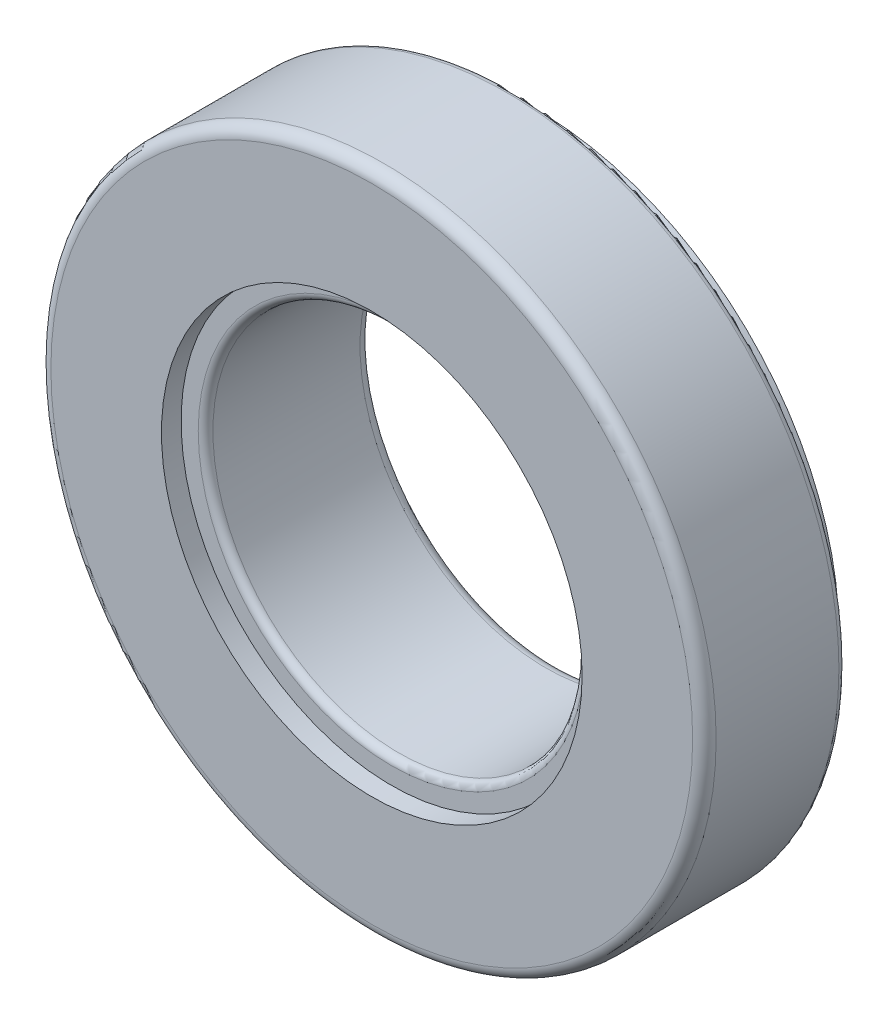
from build123d import *


with BuildPart() as part:
    # E_corps → Corps (revolve)
    with BuildSketch(Plane(origin=(0, 0, 0), x_dir=(0, 0, -1), z_dir=(1, 0, 0)), mode=Mode.PRIVATE) as corps_sk:
        with BuildLine():
            Line((2.76, 19), (17.8, 19))
            ThreePointArc((17.8, 19), (18.648528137, 19.351471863), (19, 20.2))
            Line((19, 20.2), (19, 27.1))
            Line((19, 27.1), (16.75, 27.1))
            Line((16.75, 27.1), (16.75, 31))
            Line((16.75, 31), (14.5, 30.702830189))
            Line((14.5, 30.702830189), (14.5, 33.25))
            ThreePointArc((14.5, 33.25), (14.280330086, 33.780330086), (13.75, 34))
            Line((13.75, 34), (1.2, 34))
            ThreePointArc((1.2, 34), (0.351471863, 33.648528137), (0, 32.8))
            Line((0, 32.8), (0, 21.5))
            Line((0, 21.5), (2.01, 21.5))
            Line((2.01, 21.5), (2.01, 19.75))
            ThreePointArc((2.01, 19.75), (2.229669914, 19.219669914), (2.76, 19))
        make_face()
    revolve(corps_sk.sketch.rotate(Axis((0, 0, 59.991321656), (0, 0, -1)), 90), axis=Axis((0, 0, 59.991321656), (0, 0, -1)))

    # E_symbole1 → Symbole1 (revolve, cut)
    with BuildSketch(Plane(origin=(0, 0, 0), x_dir=(0, 0, -1), z_dir=(1, 0, 0)), mode=Mode.PRIVATE) as symbole1_sk:
        Polygon((0.015809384, 28.78478046), (0.0145, 28.794694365), (14.484190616, 30.705785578), (14.4855, 30.695871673), align=None)
    revolve(symbole1_sk.sketch.rotate(Axis((0, 0, 40.122853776), (0, 0, -1)), 90), axis=Axis((0, 0, 40.122853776), (0, 0, -1)), mode=Mode.SUBTRACT)

    # E_sybole2 → Symbole2 (revolve, cut)
    with BuildSketch(Plane(origin=(0, 0, 0), x_dir=(0, 0, -1), z_dir=(1, 0, 0)), mode=Mode.PRIVATE) as symbole2_sk:
        Polygon((13.093135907, 26.744538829), (5.905554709, 25.795235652), (5.906864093, 25.785321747), (13.094445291, 26.734624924), align=None)
    revolve(symbole2_sk.sketch.rotate(Axis((0, 0, 18.896952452), (0, 0, -1)), 90), axis=Axis((0, 0, 18.896952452), (0, 0, -1)), mode=Mode.SUBTRACT)


solid = part.part
